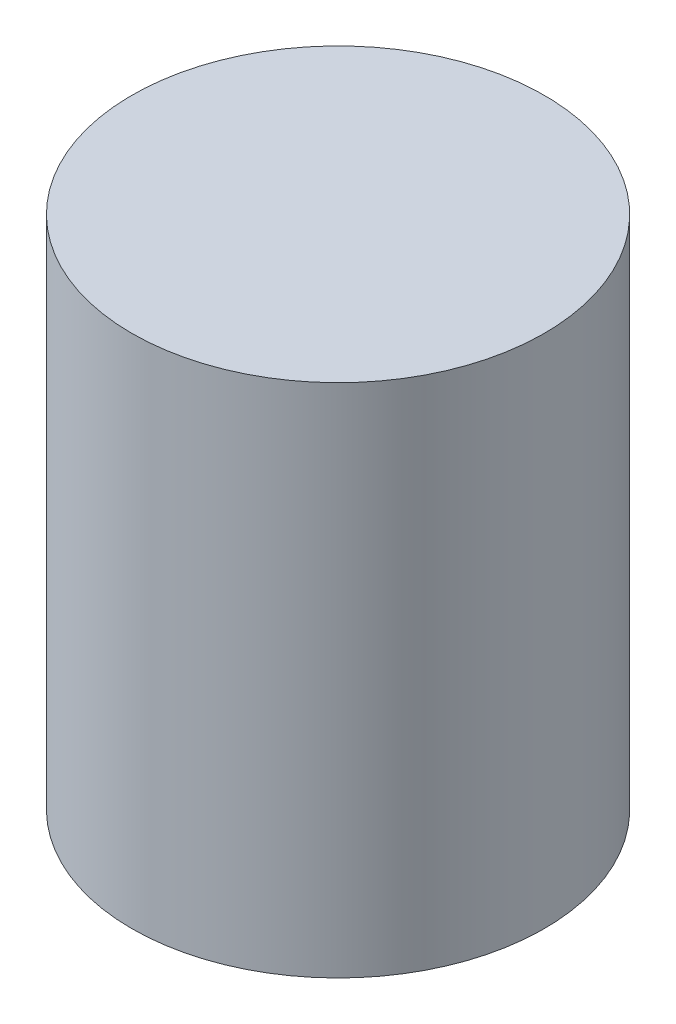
ISO-10303-21;
HEADER;
FILE_DESCRIPTION(('STEP AP214'),'2;1');
FILE_NAME('part.step','',(''),(''),'','','');
FILE_SCHEMA(('AUTOMOTIVE_DESIGN { 1 0 10303 214 1 1 1 1 }'));
ENDSEC;
DATA;
#1=APPLICATION_CONTEXT('core data for automotive mechanical design processes');
#2=APPLICATION_PROTOCOL_DEFINITION('international standard','automotive_design',2000,#1);
#3=PRODUCT_CONTEXT('',#1,'mechanical');
#4=PRODUCT('Part','Part','',(#3));
#5=PRODUCT_RELATED_PRODUCT_CATEGORY('part','',(#4));
#6=PRODUCT_DEFINITION_FORMATION('','',#4);
#7=PRODUCT_DEFINITION_CONTEXT('part definition',#1,'design');
#8=PRODUCT_DEFINITION('design','',#6,#7);
#9=PRODUCT_DEFINITION_SHAPE('','',#8);
#10=(LENGTH_UNIT() NAMED_UNIT(*) SI_UNIT(.MILLI.,.METRE.));
#11=(NAMED_UNIT(*) PLANE_ANGLE_UNIT() SI_UNIT($,.RADIAN.));
#12=(NAMED_UNIT(*) SI_UNIT($,.STERADIAN.) SOLID_ANGLE_UNIT());
#13=UNCERTAINTY_MEASURE_WITH_UNIT(LENGTH_MEASURE(1.E-05),#10,'distance_accuracy_value','');
#14=(GEOMETRIC_REPRESENTATION_CONTEXT(3) GLOBAL_UNCERTAINTY_ASSIGNED_CONTEXT((#13)) GLOBAL_UNIT_ASSIGNED_CONTEXT((#10,
#11,#12)) REPRESENTATION_CONTEXT('',''));
#15=CARTESIAN_POINT('',(0.,0.,0.));
#16=DIRECTION('',(0.,0.,1.));
#17=DIRECTION('',(1.,0.,0.));
#18=AXIS2_PLACEMENT_3D('',#15,#16,#17);
#19=CARTESIAN_POINT('',(0.,75.,0.));
#20=DIRECTION('',(0.,-1.,0.));
#21=DIRECTION('',(0.,0.,-1.));
#22=AXIS2_PLACEMENT_3D('',#19,#20,#21);
#23=CYLINDRICAL_SURFACE('',#22,30.);
#24=CARTESIAN_POINT('',(0.,75.,0.));
#25=DIRECTION('',(0.,1.,0.));
#26=DIRECTION('',(0.,0.,1.));
#27=AXIS2_PLACEMENT_3D('',#24,#25,#26);
#28=CIRCLE('',#27,30.);
#29=CARTESIAN_POINT('',(0.,75.,30.));
#30=VERTEX_POINT('',#29);
#31=EDGE_CURVE('E10',#30,#30,#28,.T.);
#32=ORIENTED_EDGE('',*,*,#31,.F.);
#33=EDGE_LOOP('',(#32));
#34=FACE_BOUND('',#33,.T.);
#35=CARTESIAN_POINT('',(0.,0.,0.));
#36=DIRECTION('',(0.,1.,0.));
#37=DIRECTION('',(0.,0.,1.));
#38=AXIS2_PLACEMENT_3D('',#35,#36,#37);
#39=CIRCLE('',#38,30.);
#40=CARTESIAN_POINT('',(0.,0.,30.));
#41=VERTEX_POINT('',#40);
#42=EDGE_CURVE('E32',#41,#41,#39,.T.);
#43=ORIENTED_EDGE('',*,*,#42,.T.);
#44=EDGE_LOOP('',(#43));
#45=FACE_BOUND('',#44,.T.);
#46=ADVANCED_FACE('F29',(#34,#45),#23,.T.);
#47=CARTESIAN_POINT('',(0.,75.,0.));
#48=DIRECTION('',(0.,1.,0.));
#49=DIRECTION('',(0.,0.,1.));
#50=AXIS2_PLACEMENT_3D('',#47,#48,#49);
#51=PLANE('',#50);
#52=ORIENTED_EDGE('',*,*,#31,.T.);
#53=EDGE_LOOP('',(#52));
#54=FACE_BOUND('',#53,.T.);
#55=ADVANCED_FACE('F44',(#54),#51,.T.);
#56=CARTESIAN_POINT('',(0.,0.,0.));
#57=DIRECTION('',(0.,1.,0.));
#58=DIRECTION('',(0.,0.,1.));
#59=AXIS2_PLACEMENT_3D('',#56,#57,#58);
#60=PLANE('',#59);
#61=ORIENTED_EDGE('',*,*,#42,.F.);
#62=EDGE_LOOP('',(#61));
#63=FACE_BOUND('',#62,.T.);
#64=ADVANCED_FACE('F42',(#63),#60,.F.);
#65=CLOSED_SHELL('',(#46,#55,#64));
#66=MANIFOLD_SOLID_BREP('B2',#65);
#67=ADVANCED_BREP_SHAPE_REPRESENTATION('',(#18,#66),#14);
#68=SHAPE_DEFINITION_REPRESENTATION(#9,#67);
ENDSEC;
END-ISO-10303-21;
